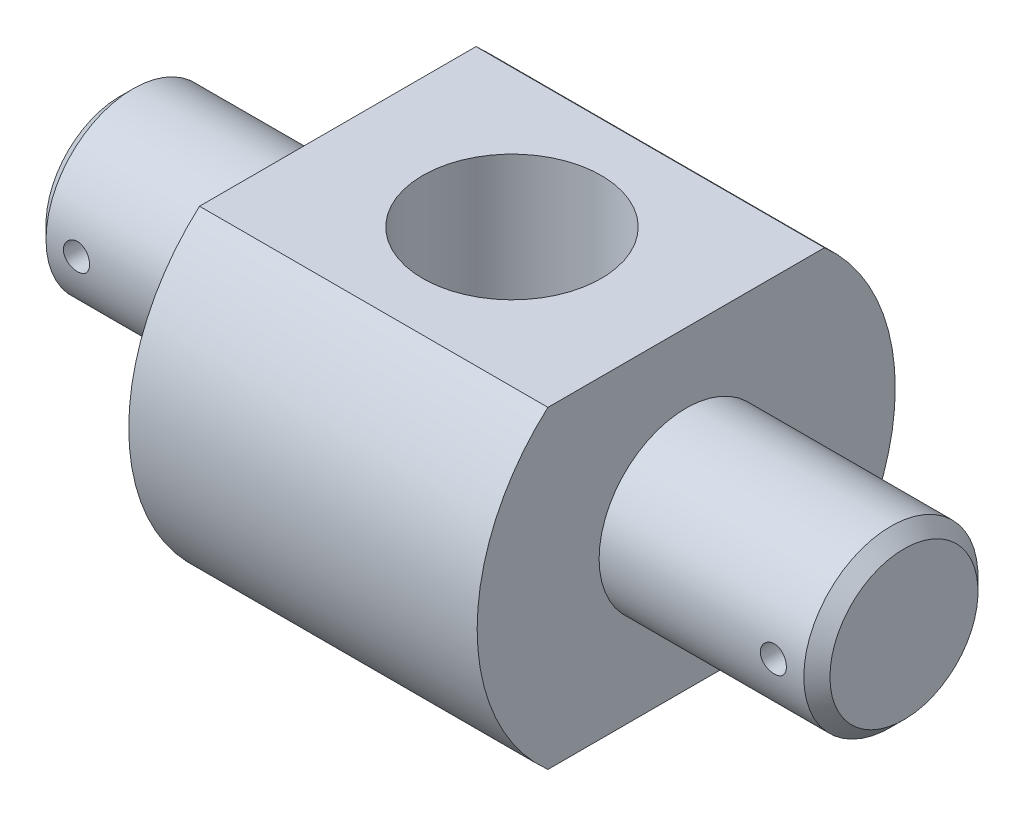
ISO-10303-21;
HEADER;
FILE_DESCRIPTION(('STEP AP214'),'2;1');
FILE_NAME('part.step','',(''),(''),'','','');
FILE_SCHEMA(('AUTOMOTIVE_DESIGN { 1 0 10303 214 1 1 1 1 }'));
ENDSEC;
DATA;
#1=APPLICATION_CONTEXT('core data for automotive mechanical design processes');
#2=APPLICATION_PROTOCOL_DEFINITION('international standard','automotive_design',2000,#1);
#3=PRODUCT_CONTEXT('',#1,'mechanical');
#4=PRODUCT('Part','Part','',(#3));
#5=PRODUCT_RELATED_PRODUCT_CATEGORY('part','',(#4));
#6=PRODUCT_DEFINITION_FORMATION('','',#4);
#7=PRODUCT_DEFINITION_CONTEXT('part definition',#1,'design');
#8=PRODUCT_DEFINITION('design','',#6,#7);
#9=PRODUCT_DEFINITION_SHAPE('','',#8);
#10=(LENGTH_UNIT() NAMED_UNIT(*) SI_UNIT(.MILLI.,.METRE.));
#11=(NAMED_UNIT(*) PLANE_ANGLE_UNIT() SI_UNIT($,.RADIAN.));
#12=(NAMED_UNIT(*) SI_UNIT($,.STERADIAN.) SOLID_ANGLE_UNIT());
#13=UNCERTAINTY_MEASURE_WITH_UNIT(LENGTH_MEASURE(1.E-05),#10,'distance_accuracy_value','');
#14=(GEOMETRIC_REPRESENTATION_CONTEXT(3) GLOBAL_UNCERTAINTY_ASSIGNED_CONTEXT((#13)) GLOBAL_UNIT_ASSIGNED_CONTEXT((#10,
#11,#12)) REPRESENTATION_CONTEXT('',''));
#15=CARTESIAN_POINT('',(0.,0.,0.));
#16=DIRECTION('',(0.,0.,1.));
#17=DIRECTION('',(1.,0.,0.));
#18=AXIS2_PLACEMENT_3D('',#15,#16,#17);
#19=CARTESIAN_POINT('',(0.,0.,0.));
#20=DIRECTION('',(-1.,0.,0.));
#21=DIRECTION('',(0.,0.,1.));
#22=AXIS2_PLACEMENT_3D('',#19,#20,#21);
#23=CYLINDRICAL_SURFACE('',#22,24.);
#24=CARTESIAN_POINT('',(65.,0.,0.));
#25=DIRECTION('',(-1.,0.,0.));
#26=DIRECTION('',(0.,0.,1.));
#27=AXIS2_PLACEMENT_3D('',#24,#25,#26);
#28=CIRCLE('',#27,24.);
#29=CARTESIAN_POINT('',(65.,18.,-15.8745078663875));
#30=VERTEX_POINT('',#29);
#31=CARTESIAN_POINT('',(65.,-18.,-15.8745078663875));
#32=VERTEX_POINT('',#31);
#33=EDGE_CURVE('E92',#30,#32,#28,.T.);
#34=ORIENTED_EDGE('',*,*,#33,.T.);
#35=DIRECTION('',(-1.,0.,0.));
#36=VECTOR('',#35,1.);
#37=CARTESIAN_POINT('',(0.,-18.,-15.8745078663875));
#38=LINE('',#37,#36);
#39=CARTESIAN_POINT('',(25.,-18.,-15.8745078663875));
#40=VERTEX_POINT('',#39);
#41=EDGE_CURVE('E54',#32,#40,#38,.T.);
#42=ORIENTED_EDGE('',*,*,#41,.T.);
#43=CARTESIAN_POINT('',(25.,0.,0.));
#44=DIRECTION('',(-1.,0.,0.));
#45=DIRECTION('',(0.,0.,1.));
#46=AXIS2_PLACEMENT_3D('',#43,#44,#45);
#47=CIRCLE('',#46,24.);
#48=CARTESIAN_POINT('',(25.,18.,-15.8745078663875));
#49=VERTEX_POINT('',#48);
#50=EDGE_CURVE('E100',#49,#40,#47,.T.);
#51=ORIENTED_EDGE('',*,*,#50,.F.);
#52=DIRECTION('',(-1.,0.,0.));
#53=VECTOR('',#52,1.);
#54=CARTESIAN_POINT('',(0.,18.,-15.8745078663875));
#55=LINE('',#54,#53);
#56=EDGE_CURVE('E205',#49,#30,#55,.F.);
#57=ORIENTED_EDGE('',*,*,#56,.T.);
#58=EDGE_LOOP('',(#34,#42,#51,#57));
#59=FACE_BOUND('',#58,.T.);
#60=ADVANCED_FACE('F33',(#59),#23,.T.);
#61=CARTESIAN_POINT('',(0.,0.,0.));
#62=DIRECTION('',(1.,0.,0.));
#63=DIRECTION('',(0.,0.,-1.));
#64=AXIS2_PLACEMENT_3D('',#61,#62,#63);
#65=PLANE('',#64);
#66=CARTESIAN_POINT('',(0.,0.,0.));
#67=DIRECTION('',(1.,0.,0.));
#68=DIRECTION('',(0.,0.,-1.));
#69=AXIS2_PLACEMENT_3D('',#66,#67,#68);
#70=CIRCLE('',#69,8.49999999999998);
#71=CARTESIAN_POINT('',(0.,0.,-8.49999999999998));
#72=VERTEX_POINT('',#71);
#73=EDGE_CURVE('E112',#72,#72,#70,.F.);
#74=ORIENTED_EDGE('',*,*,#73,.T.);
#75=EDGE_LOOP('',(#74));
#76=FACE_BOUND('',#75,.T.);
#77=ADVANCED_FACE('F35',(#76),#65,.F.);
#78=CARTESIAN_POINT('',(0.,0.,0.));
#79=DIRECTION('',(-1.,0.,0.));
#80=DIRECTION('',(0.,0.,1.));
#81=AXIS2_PLACEMENT_3D('',#78,#79,#80);
#82=CYLINDRICAL_SURFACE('',#81,9.99999999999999);
#83=CARTESIAN_POINT('',(6.5,0.,9.99999999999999));
#84=CARTESIAN_POINT('',(6.49999654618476,-0.0837515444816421,9.99999865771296));
#85=CARTESIAN_POINT('',(6.49296199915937,-0.167551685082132,9.99893682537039));
#86=CARTESIAN_POINT('',(6.46501680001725,-0.332809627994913,9.99480315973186));
#87=CARTESIAN_POINT('',(6.44409263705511,-0.414265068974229,9.99172936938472));
#88=CARTESIAN_POINT('',(6.38900749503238,-0.57241808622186,9.98391721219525));
#89=CARTESIAN_POINT('',(6.35485652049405,-0.649119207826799,9.97918010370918));
#90=CARTESIAN_POINT('',(6.27431162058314,-0.795690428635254,9.96856475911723));
#91=CARTESIAN_POINT('',(6.22791939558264,-0.865561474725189,9.96268668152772));
#92=CARTESIAN_POINT('',(6.12382273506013,-0.997046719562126,9.95039170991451));
#93=CARTESIAN_POINT('',(6.0660415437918,-1.0585998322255,9.9439713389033));
#94=CARTESIAN_POINT('',(5.94097231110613,-1.17117490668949,9.93134261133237));
#95=CARTESIAN_POINT('',(5.87368372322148,-1.22219626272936,9.92513426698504));
#96=CARTESIAN_POINT('',(5.73109935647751,-1.31249729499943,9.91359877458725));
#97=CARTESIAN_POINT('',(5.65576575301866,-1.35171787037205,9.9082761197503));
#98=CARTESIAN_POINT('',(5.49948717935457,-1.41692632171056,9.89916211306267));
#99=CARTESIAN_POINT('',(5.41854251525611,-1.44291491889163,9.89537067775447));
#100=CARTESIAN_POINT('',(5.25398195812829,-1.48073198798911,9.88978256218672));
#101=CARTESIAN_POINT('',(5.17039060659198,-1.49266503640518,9.88797115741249));
#102=CARTESIAN_POINT('',(5.00237383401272,-1.50235624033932,9.88650348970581));
#103=CARTESIAN_POINT('',(4.91794846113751,-1.50011520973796,9.88684710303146));
#104=CARTESIAN_POINT('',(4.75139891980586,-1.48160733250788,9.88963718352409));
#105=CARTESIAN_POINT('',(4.6692614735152,-1.4654569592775,9.89206618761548));
#106=CARTESIAN_POINT('',(4.50887563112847,-1.41977117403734,9.89872608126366));
#107=CARTESIAN_POINT('',(4.43062734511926,-1.39023538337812,9.90295702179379));
#108=CARTESIAN_POINT('',(4.27988662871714,-1.31849603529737,9.9127633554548));
#109=CARTESIAN_POINT('',(4.20741803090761,-1.27624314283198,9.91834396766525));
#110=CARTESIAN_POINT('',(4.07055540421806,-1.18030413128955,9.93021707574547));
#111=CARTESIAN_POINT('',(4.00616190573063,-1.12661726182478,9.936509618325));
#112=CARTESIAN_POINT('',(3.88660233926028,-1.00869493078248,9.94917473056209));
#113=CARTESIAN_POINT('',(3.83153500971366,-0.944359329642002,9.95554747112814));
#114=CARTESIAN_POINT('',(3.73296406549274,-0.807307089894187,9.96759647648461));
#115=CARTESIAN_POINT('',(3.6894605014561,-0.73459041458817,9.97327273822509));
#116=CARTESIAN_POINT('',(3.61524691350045,-0.582754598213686,9.98329515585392));
#117=CARTESIAN_POINT('',(3.5845445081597,-0.50363167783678,9.98764051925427));
#118=CARTESIAN_POINT('',(3.53689061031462,-0.341273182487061,9.99450490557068));
#119=CARTESIAN_POINT('',(3.51993818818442,-0.258037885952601,9.99702405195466));
#120=CARTESIAN_POINT('',(3.5003967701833,-0.090669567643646,9.9999358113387));
#121=CARTESIAN_POINT('',(3.49767202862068,-0.00655273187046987,10.0003485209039));
#122=CARTESIAN_POINT('',(3.50630300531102,0.160936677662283,9.99905561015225));
#123=CARTESIAN_POINT('',(3.5176582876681,0.244309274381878,9.99735005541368));
#124=CARTESIAN_POINT('',(3.55401410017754,0.407532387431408,9.99202468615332));
#125=CARTESIAN_POINT('',(3.57894849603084,0.487397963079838,9.98841415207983));
#126=CARTESIAN_POINT('',(3.64168499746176,0.641814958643,9.97968235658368));
#127=CARTESIAN_POINT('',(3.67948770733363,0.7163661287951,9.97456102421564));
#128=CARTESIAN_POINT('',(3.76720622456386,0.858634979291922,9.96332682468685));
#129=CARTESIAN_POINT('',(3.81720814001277,0.926299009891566,9.95720701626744));
#130=CARTESIAN_POINT('',(3.92778581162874,1.05232367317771,9.94467863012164));
#131=CARTESIAN_POINT('',(3.98836218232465,1.1106837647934,9.93827003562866));
#132=CARTESIAN_POINT('',(4.11897353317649,1.21693784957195,9.92582264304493));
#133=CARTESIAN_POINT('',(4.18908292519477,1.26474084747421,9.91978736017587));
#134=CARTESIAN_POINT('',(4.33641604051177,1.34789129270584,9.90883219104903));
#135=CARTESIAN_POINT('',(4.41363957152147,1.38323907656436,9.90391227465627));
#136=CARTESIAN_POINT('',(4.57273753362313,1.44033467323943,9.89577033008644));
#137=CARTESIAN_POINT('',(4.65459446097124,1.46213037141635,9.89254233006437));
#138=CARTESIAN_POINT('',(4.82085901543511,1.49165549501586,9.88813382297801));
#139=CARTESIAN_POINT('',(4.90526646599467,1.49938589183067,9.8869531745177));
#140=CARTESIAN_POINT('',(5.07332906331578,1.5005378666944,9.8867783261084));
#141=CARTESIAN_POINT('',(5.15698324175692,1.49410252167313,9.88776226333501));
#142=CARTESIAN_POINT('',(5.32200526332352,1.46741229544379,9.89175820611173));
#143=CARTESIAN_POINT('',(5.40337311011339,1.44715743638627,9.89477020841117));
#144=CARTESIAN_POINT('',(5.56147308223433,1.39345373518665,9.90247526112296));
#145=CARTESIAN_POINT('',(5.63820867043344,1.36001489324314,9.90716703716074));
#146=CARTESIAN_POINT('',(5.7850036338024,1.28090667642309,9.91770454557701));
#147=CARTESIAN_POINT('',(5.85506278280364,1.23523688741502,9.92355031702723));
#148=CARTESIAN_POINT('',(5.98724305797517,1.13244337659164,9.93580743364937));
#149=CARTESIAN_POINT('',(6.04928133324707,1.07521369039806,9.94222367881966));
#150=CARTESIAN_POINT('',(6.16292455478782,0.951148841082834,9.95485788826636));
#151=CARTESIAN_POINT('',(6.21452707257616,0.884311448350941,9.96107580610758));
#152=CARTESIAN_POINT('',(6.30608767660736,0.742495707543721,9.97265185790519));
#153=CARTESIAN_POINT('',(6.34598010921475,0.66747457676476,9.97800507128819));
#154=CARTESIAN_POINT('',(6.41253851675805,0.511751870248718,9.98720028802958));
#155=CARTESIAN_POINT('',(6.43921819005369,0.431056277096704,9.99104385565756));
#156=CARTESIAN_POINT('',(6.47254134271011,0.291665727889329,9.99590939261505));
#157=CARTESIAN_POINT('',(6.48282260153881,0.233831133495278,9.99743549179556));
#158=CARTESIAN_POINT('',(6.49655309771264,0.117338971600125,9.99948125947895));
#159=CARTESIAN_POINT('',(6.50000241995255,0.0586814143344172,10.0000009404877));
#160=CARTESIAN_POINT('',(6.5,0.,9.99999999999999));
#161=B_SPLINE_CURVE_WITH_KNOTS('',3,(#83,#84,#85,#86,#87,#88,#89,#90,#91,#92,#93,#94,#95,#96,
#97,#98,#99,#100,#101,#102,#103,#104,#105,#106,#107,#108,#109,#110,#111,#112,#113,#114,#115,
#116,#117,#118,#119,#120,#121,#122,#123,#124,#125,#126,#127,#128,#129,#130,#131,#132,#133,#134,
#135,#136,#137,#138,#139,#140,#141,#142,#143,#144,#145,#146,#147,#148,#149,#150,#151,#152,#153,
#154,#155,#156,#157,#158,#159,#160),.UNSPECIFIED.,.T.,.F.,(4,2,2,2,2,2,2,2,2,2,2,2,2,2,2,2,2,2,
2,2,2,2,2,2,2,2,2,2,2,2,2,2,2,2,2,2,2,2,4),(0.,0.251040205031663,0.502324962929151,
0.753420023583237,1.0044802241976,1.25729416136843,1.5101226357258,1.76419702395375,
2.01825756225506,2.27041564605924,2.52255925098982,2.77261177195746,3.02267136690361,
3.27371383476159,3.52477278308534,3.77834291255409,4.03191415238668,4.28563608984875,
4.53934087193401,4.79062058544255,5.04189251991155,5.29195148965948,5.54202220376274,
5.79391188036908,6.0458162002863,6.29981366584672,6.55380426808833,6.80689223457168,
7.05996272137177,7.31048888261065,7.56101464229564,7.81135073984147,8.0616953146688,
8.31444829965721,8.56726003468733,8.82146323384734,9.07540233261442,9.25129851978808,
9.42719252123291),.UNSPECIFIED.);
#162=CARTESIAN_POINT('',(6.5,0.,9.99999999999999));
#163=VERTEX_POINT('',#162);
#164=EDGE_CURVE('E125',#163,#163,#161,.T.);
#165=ORIENTED_EDGE('',*,*,#164,.T.);
#166=EDGE_LOOP('',(#165));
#167=FACE_BOUND('',#166,.T.);
#168=CARTESIAN_POINT('',(6.5,0.,-9.99999999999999));
#169=CARTESIAN_POINT('',(6.49999654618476,0.0837515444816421,-9.99999865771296));
#170=CARTESIAN_POINT('',(6.49296199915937,0.167551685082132,-9.99893682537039));
#171=CARTESIAN_POINT('',(6.46501680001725,0.332809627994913,-9.99480315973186));
#172=CARTESIAN_POINT('',(6.44409263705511,0.414265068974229,-9.99172936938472));
#173=CARTESIAN_POINT('',(6.38900749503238,0.57241808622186,-9.98391721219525));
#174=CARTESIAN_POINT('',(6.35485652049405,0.649119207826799,-9.97918010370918));
#175=CARTESIAN_POINT('',(6.27431162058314,0.795690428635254,-9.96856475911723));
#176=CARTESIAN_POINT('',(6.22791939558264,0.865561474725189,-9.96268668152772));
#177=CARTESIAN_POINT('',(6.12382273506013,0.997046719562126,-9.95039170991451));
#178=CARTESIAN_POINT('',(6.0660415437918,1.0585998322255,-9.9439713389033));
#179=CARTESIAN_POINT('',(5.94097231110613,1.17117490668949,-9.93134261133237));
#180=CARTESIAN_POINT('',(5.87368372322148,1.22219626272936,-9.92513426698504));
#181=CARTESIAN_POINT('',(5.73109935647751,1.31249729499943,-9.91359877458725));
#182=CARTESIAN_POINT('',(5.65576575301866,1.35171787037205,-9.9082761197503));
#183=CARTESIAN_POINT('',(5.49948717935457,1.41692632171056,-9.89916211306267));
#184=CARTESIAN_POINT('',(5.41854251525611,1.44291491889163,-9.89537067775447));
#185=CARTESIAN_POINT('',(5.25398195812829,1.48073198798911,-9.88978256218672));
#186=CARTESIAN_POINT('',(5.17039060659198,1.49266503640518,-9.88797115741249));
#187=CARTESIAN_POINT('',(5.00237383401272,1.50235624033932,-9.88650348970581));
#188=CARTESIAN_POINT('',(4.91794846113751,1.50011520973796,-9.88684710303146));
#189=CARTESIAN_POINT('',(4.75139891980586,1.48160733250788,-9.88963718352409));
#190=CARTESIAN_POINT('',(4.6692614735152,1.4654569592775,-9.89206618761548));
#191=CARTESIAN_POINT('',(4.50887563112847,1.41977117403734,-9.89872608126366));
#192=CARTESIAN_POINT('',(4.43062734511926,1.39023538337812,-9.90295702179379));
#193=CARTESIAN_POINT('',(4.27988662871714,1.31849603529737,-9.9127633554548));
#194=CARTESIAN_POINT('',(4.20741803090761,1.27624314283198,-9.91834396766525));
#195=CARTESIAN_POINT('',(4.07055540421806,1.18030413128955,-9.93021707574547));
#196=CARTESIAN_POINT('',(4.00616190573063,1.12661726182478,-9.936509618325));
#197=CARTESIAN_POINT('',(3.88660233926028,1.00869493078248,-9.94917473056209));
#198=CARTESIAN_POINT('',(3.83153500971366,0.944359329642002,-9.95554747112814));
#199=CARTESIAN_POINT('',(3.73296406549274,0.807307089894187,-9.96759647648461));
#200=CARTESIAN_POINT('',(3.6894605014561,0.73459041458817,-9.97327273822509));
#201=CARTESIAN_POINT('',(3.61524691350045,0.582754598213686,-9.98329515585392));
#202=CARTESIAN_POINT('',(3.5845445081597,0.50363167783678,-9.98764051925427));
#203=CARTESIAN_POINT('',(3.53689061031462,0.341273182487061,-9.99450490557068));
#204=CARTESIAN_POINT('',(3.51993818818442,0.258037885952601,-9.99702405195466));
#205=CARTESIAN_POINT('',(3.5003967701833,0.090669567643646,-9.9999358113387));
#206=CARTESIAN_POINT('',(3.49767202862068,0.00655273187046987,-10.0003485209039));
#207=CARTESIAN_POINT('',(3.50630300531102,-0.160936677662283,-9.99905561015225));
#208=CARTESIAN_POINT('',(3.5176582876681,-0.244309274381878,-9.99735005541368));
#209=CARTESIAN_POINT('',(3.55401410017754,-0.407532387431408,-9.99202468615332));
#210=CARTESIAN_POINT('',(3.57894849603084,-0.487397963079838,-9.98841415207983));
#211=CARTESIAN_POINT('',(3.64168499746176,-0.641814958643,-9.97968235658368));
#212=CARTESIAN_POINT('',(3.67948770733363,-0.7163661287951,-9.97456102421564));
#213=CARTESIAN_POINT('',(3.76720622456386,-0.858634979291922,-9.96332682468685));
#214=CARTESIAN_POINT('',(3.81720814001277,-0.926299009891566,-9.95720701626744));
#215=CARTESIAN_POINT('',(3.92778581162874,-1.05232367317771,-9.94467863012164));
#216=CARTESIAN_POINT('',(3.98836218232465,-1.1106837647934,-9.93827003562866));
#217=CARTESIAN_POINT('',(4.11897353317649,-1.21693784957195,-9.92582264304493));
#218=CARTESIAN_POINT('',(4.18908292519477,-1.26474084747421,-9.91978736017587));
#219=CARTESIAN_POINT('',(4.33641604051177,-1.34789129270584,-9.90883219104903));
#220=CARTESIAN_POINT('',(4.41363957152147,-1.38323907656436,-9.90391227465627));
#221=CARTESIAN_POINT('',(4.57273753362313,-1.44033467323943,-9.89577033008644));
#222=CARTESIAN_POINT('',(4.65459446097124,-1.46213037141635,-9.89254233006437));
#223=CARTESIAN_POINT('',(4.82085901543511,-1.49165549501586,-9.88813382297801));
#224=CARTESIAN_POINT('',(4.90526646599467,-1.49938589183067,-9.8869531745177));
#225=CARTESIAN_POINT('',(5.07332906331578,-1.5005378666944,-9.8867783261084));
#226=CARTESIAN_POINT('',(5.15698324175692,-1.49410252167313,-9.88776226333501));
#227=CARTESIAN_POINT('',(5.32200526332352,-1.46741229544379,-9.89175820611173));
#228=CARTESIAN_POINT('',(5.40337311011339,-1.44715743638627,-9.89477020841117));
#229=CARTESIAN_POINT('',(5.56147308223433,-1.39345373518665,-9.90247526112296));
#230=CARTESIAN_POINT('',(5.63820867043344,-1.36001489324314,-9.90716703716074));
#231=CARTESIAN_POINT('',(5.7850036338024,-1.28090667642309,-9.91770454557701));
#232=CARTESIAN_POINT('',(5.85506278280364,-1.23523688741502,-9.92355031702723));
#233=CARTESIAN_POINT('',(5.98724305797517,-1.13244337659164,-9.93580743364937));
#234=CARTESIAN_POINT('',(6.04928133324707,-1.07521369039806,-9.94222367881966));
#235=CARTESIAN_POINT('',(6.16292455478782,-0.951148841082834,-9.95485788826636));
#236=CARTESIAN_POINT('',(6.21452707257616,-0.884311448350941,-9.96107580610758));
#237=CARTESIAN_POINT('',(6.30608767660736,-0.742495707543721,-9.97265185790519));
#238=CARTESIAN_POINT('',(6.34598010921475,-0.66747457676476,-9.97800507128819));
#239=CARTESIAN_POINT('',(6.41253851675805,-0.511751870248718,-9.98720028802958));
#240=CARTESIAN_POINT('',(6.43921819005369,-0.431056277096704,-9.99104385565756));
#241=CARTESIAN_POINT('',(6.47254134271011,-0.291665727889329,-9.99590939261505));
#242=CARTESIAN_POINT('',(6.48282260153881,-0.233831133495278,-9.99743549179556));
#243=CARTESIAN_POINT('',(6.49655309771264,-0.117338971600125,-9.99948125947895));
#244=CARTESIAN_POINT('',(6.50000241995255,-0.0586814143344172,-10.0000009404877));
#245=CARTESIAN_POINT('',(6.5,0.,-9.99999999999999));
#246=B_SPLINE_CURVE_WITH_KNOTS('',3,(#168,#169,#170,#171,#172,#173,#174,#175,#176,#177,#178,
#179,#180,#181,#182,#183,#184,#185,#186,#187,#188,#189,#190,#191,#192,#193,#194,#195,#196,#197,
#198,#199,#200,#201,#202,#203,#204,#205,#206,#207,#208,#209,#210,#211,#212,#213,#214,#215,#216,
#217,#218,#219,#220,#221,#222,#223,#224,#225,#226,#227,#228,#229,#230,#231,#232,#233,#234,#235,
#236,#237,#238,#239,#240,#241,#242,#243,#244,#245),.UNSPECIFIED.,.T.,.F.,(4,2,2,2,2,2,2,2,2,2,2,
2,2,2,2,2,2,2,2,2,2,2,2,2,2,2,2,2,2,2,2,2,2,2,2,2,2,2,4),(0.,0.251040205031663,
0.502324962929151,0.753420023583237,1.0044802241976,1.25729416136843,1.5101226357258,
1.76419702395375,2.01825756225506,2.27041564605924,2.52255925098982,2.77261177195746,
3.02267136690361,3.27371383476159,3.52477278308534,3.77834291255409,4.03191415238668,
4.28563608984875,4.53934087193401,4.79062058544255,5.04189251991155,5.29195148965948,
5.54202220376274,5.79391188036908,6.0458162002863,6.29981366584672,6.55380426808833,
6.80689223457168,7.05996272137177,7.31048888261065,7.56101464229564,7.81135073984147,
8.0616953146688,8.31444829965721,8.56726003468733,8.82146323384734,9.07540233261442,
9.25129851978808,9.42719252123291),.UNSPECIFIED.);
#247=CARTESIAN_POINT('',(6.5,0.,-9.99999999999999));
#248=VERTEX_POINT('',#247);
#249=EDGE_CURVE('E119',#248,#248,#246,.T.);
#250=ORIENTED_EDGE('',*,*,#249,.T.);
#251=EDGE_LOOP('',(#250));
#252=FACE_BOUND('',#251,.T.);
#253=CARTESIAN_POINT('',(1.50000000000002,0.,0.));
#254=DIRECTION('',(1.,0.,0.));
#255=DIRECTION('',(0.,0.,-1.));
#256=AXIS2_PLACEMENT_3D('',#253,#254,#255);
#257=CIRCLE('',#256,9.99999999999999);
#258=CARTESIAN_POINT('',(1.50000000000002,0.,-9.99999999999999));
#259=VERTEX_POINT('',#258);
#260=EDGE_CURVE('E115',#259,#259,#257,.T.);
#261=ORIENTED_EDGE('',*,*,#260,.T.);
#262=EDGE_LOOP('',(#261));
#263=FACE_BOUND('',#262,.T.);
#264=CARTESIAN_POINT('',(25.,0.,0.));
#265=DIRECTION('',(-1.,0.,0.));
#266=DIRECTION('',(0.,0.,1.));
#267=AXIS2_PLACEMENT_3D('',#264,#265,#266);
#268=CIRCLE('',#267,9.99999999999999);
#269=CARTESIAN_POINT('',(25.,0.,9.99999999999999));
#270=VERTEX_POINT('',#269);
#271=EDGE_CURVE('E103',#270,#270,#268,.T.);
#272=ORIENTED_EDGE('',*,*,#271,.T.);
#273=EDGE_LOOP('',(#272));
#274=FACE_BOUND('',#273,.T.);
#275=ADVANCED_FACE('F128',(#167,#252,#263,#274),#82,.T.);
#276=CARTESIAN_POINT('',(25.,9.99999999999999,0.));
#277=DIRECTION('',(1.,0.,0.));
#278=DIRECTION('',(0.,0.,-1.));
#279=AXIS2_PLACEMENT_3D('',#276,#277,#278);
#280=PLANE('',#279);
#281=ORIENTED_EDGE('',*,*,#271,.F.);
#282=EDGE_LOOP('',(#281));
#283=FACE_BOUND('',#282,.T.);
#284=ORIENTED_EDGE('',*,*,#50,.T.);
#285=DIRECTION('',(0.,0.,1.));
#286=VECTOR('',#285,1.);
#287=CARTESIAN_POINT('',(25.,-18.,0.));
#288=LINE('',#287,#286);
#289=CARTESIAN_POINT('',(25.,-18.,15.8745078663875));
#290=VERTEX_POINT('',#289);
#291=EDGE_CURVE('E202',#40,#290,#288,.T.);
#292=ORIENTED_EDGE('',*,*,#291,.T.);
#293=CARTESIAN_POINT('',(25.,18.,15.8745078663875));
#294=VERTEX_POINT('',#293);
#295=EDGE_CURVE('E86',#290,#294,#47,.T.);
#296=ORIENTED_EDGE('',*,*,#295,.T.);
#297=DIRECTION('',(0.,0.,-1.));
#298=VECTOR('',#297,1.);
#299=CARTESIAN_POINT('',(25.,18.,0.));
#300=LINE('',#299,#298);
#301=EDGE_CURVE('E96',#294,#49,#300,.T.);
#302=ORIENTED_EDGE('',*,*,#301,.T.);
#303=EDGE_LOOP('',(#284,#292,#296,#302));
#304=FACE_BOUND('',#303,.T.);
#305=ADVANCED_FACE('F188',(#283,#304),#280,.F.);
#306=ORIENTED_EDGE('',*,*,#295,.F.);
#307=DIRECTION('',(-1.,0.,0.));
#308=VECTOR('',#307,1.);
#309=CARTESIAN_POINT('',(0.,-18.,15.8745078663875));
#310=LINE('',#309,#308);
#311=CARTESIAN_POINT('',(65.,-18.,15.8745078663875));
#312=VERTEX_POINT('',#311);
#313=EDGE_CURVE('E79',#290,#312,#310,.F.);
#314=ORIENTED_EDGE('',*,*,#313,.T.);
#315=CARTESIAN_POINT('',(65.,18.,15.8745078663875));
#316=VERTEX_POINT('',#315);
#317=EDGE_CURVE('E61',#312,#316,#28,.T.);
#318=ORIENTED_EDGE('',*,*,#317,.T.);
#319=DIRECTION('',(-1.,0.,0.));
#320=VECTOR('',#319,1.);
#321=CARTESIAN_POINT('',(0.,18.,15.8745078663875));
#322=LINE('',#321,#320);
#323=EDGE_CURVE('E211',#316,#294,#322,.T.);
#324=ORIENTED_EDGE('',*,*,#323,.T.);
#325=EDGE_LOOP('',(#306,#314,#318,#324));
#326=FACE_BOUND('',#325,.T.);
#327=ADVANCED_FACE('F85',(#326),#23,.T.);
#328=CARTESIAN_POINT('',(65.,24.,0.));
#329=DIRECTION('',(-1.,0.,0.));
#330=DIRECTION('',(0.,0.,1.));
#331=AXIS2_PLACEMENT_3D('',#328,#329,#330);
#332=PLANE('',#331);
#333=ORIENTED_EDGE('',*,*,#317,.F.);
#334=DIRECTION('',(0.,0.,-1.));
#335=VECTOR('',#334,1.);
#336=CARTESIAN_POINT('',(65.,-18.,0.));
#337=LINE('',#336,#335);
#338=EDGE_CURVE('E11',#312,#32,#337,.T.);
#339=ORIENTED_EDGE('',*,*,#338,.T.);
#340=ORIENTED_EDGE('',*,*,#33,.F.);
#341=DIRECTION('',(0.,0.,1.));
#342=VECTOR('',#341,1.);
#343=CARTESIAN_POINT('',(65.,18.,0.));
#344=LINE('',#343,#342);
#345=EDGE_CURVE('E46',#30,#316,#344,.T.);
#346=ORIENTED_EDGE('',*,*,#345,.T.);
#347=EDGE_LOOP('',(#333,#339,#340,#346));
#348=FACE_BOUND('',#347,.T.);
#349=CARTESIAN_POINT('',(65.,0.,0.));
#350=DIRECTION('',(-1.,0.,0.));
#351=DIRECTION('',(0.,0.,1.));
#352=AXIS2_PLACEMENT_3D('',#349,#350,#351);
#353=CIRCLE('',#352,9.99999999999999);
#354=CARTESIAN_POINT('',(65.,0.,9.99999999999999));
#355=VERTEX_POINT('',#354);
#356=EDGE_CURVE('E93',#355,#355,#353,.T.);
#357=ORIENTED_EDGE('',*,*,#356,.T.);
#358=EDGE_LOOP('',(#357));
#359=FACE_BOUND('',#358,.T.);
#360=ADVANCED_FACE('F90',(#348,#359),#332,.F.);
#361=CARTESIAN_POINT('',(0.,0.,0.));
#362=DIRECTION('',(-1.,0.,0.));
#363=DIRECTION('',(0.,0.,1.));
#364=AXIS2_PLACEMENT_3D('',#361,#362,#363);
#365=CYLINDRICAL_SURFACE('',#364,9.99999999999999);
#366=CARTESIAN_POINT('',(86.5,0.,9.99999999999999));
#367=CARTESIAN_POINT('',(86.4999965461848,-0.0837515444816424,9.99999865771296));
#368=CARTESIAN_POINT('',(86.4929619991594,-0.167551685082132,9.99893682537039));
#369=CARTESIAN_POINT('',(86.4650168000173,-0.332809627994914,9.99480315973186));
#370=CARTESIAN_POINT('',(86.4440926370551,-0.414265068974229,9.99172936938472));
#371=CARTESIAN_POINT('',(86.3890074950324,-0.572418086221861,9.98391721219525));
#372=CARTESIAN_POINT('',(86.3548565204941,-0.649119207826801,9.97918010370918));
#373=CARTESIAN_POINT('',(86.2743116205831,-0.795690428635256,9.96856475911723));
#374=CARTESIAN_POINT('',(86.2279193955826,-0.86556147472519,9.96268668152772));
#375=CARTESIAN_POINT('',(86.1238227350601,-0.997046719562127,9.95039170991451));
#376=CARTESIAN_POINT('',(86.0660415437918,-1.0585998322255,9.9439713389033));
#377=CARTESIAN_POINT('',(85.9409723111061,-1.17117490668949,9.93134261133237));
#378=CARTESIAN_POINT('',(85.8736837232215,-1.22219626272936,9.92513426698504));
#379=CARTESIAN_POINT('',(85.7310993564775,-1.31249729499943,9.91359877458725));
#380=CARTESIAN_POINT('',(85.6557657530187,-1.35171787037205,9.9082761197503));
#381=CARTESIAN_POINT('',(85.4994871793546,-1.41692632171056,9.89916211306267));
#382=CARTESIAN_POINT('',(85.4185425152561,-1.44291491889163,9.89537067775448));
#383=CARTESIAN_POINT('',(85.2539819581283,-1.48073198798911,9.88978256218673));
#384=CARTESIAN_POINT('',(85.170390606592,-1.49266503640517,9.8879711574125));
#385=CARTESIAN_POINT('',(85.0023738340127,-1.50235624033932,9.88650348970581));
#386=CARTESIAN_POINT('',(84.9179484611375,-1.50011520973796,9.88684710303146));
#387=CARTESIAN_POINT('',(84.7513989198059,-1.48160733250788,9.88963718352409));
#388=CARTESIAN_POINT('',(84.6692614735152,-1.4654569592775,9.89206618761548));
#389=CARTESIAN_POINT('',(84.5088756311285,-1.41977117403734,9.89872608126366));
#390=CARTESIAN_POINT('',(84.4306273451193,-1.39023538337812,9.90295702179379));
#391=CARTESIAN_POINT('',(84.2798866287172,-1.31849603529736,9.9127633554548));
#392=CARTESIAN_POINT('',(84.2074180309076,-1.27624314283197,9.91834396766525));
#393=CARTESIAN_POINT('',(84.0705554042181,-1.18030413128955,9.93021707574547));
#394=CARTESIAN_POINT('',(84.0061619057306,-1.12661726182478,9.936509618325));
#395=CARTESIAN_POINT('',(83.8866023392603,-1.00869493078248,9.94917473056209));
#396=CARTESIAN_POINT('',(83.8315350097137,-0.944359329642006,9.95554747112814));
#397=CARTESIAN_POINT('',(83.7329640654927,-0.807307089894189,9.96759647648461));
#398=CARTESIAN_POINT('',(83.6894605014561,-0.734590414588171,9.97327273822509));
#399=CARTESIAN_POINT('',(83.6152469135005,-0.582754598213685,9.98329515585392));
#400=CARTESIAN_POINT('',(83.5845445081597,-0.50363167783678,9.98764051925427));
#401=CARTESIAN_POINT('',(83.5368906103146,-0.341273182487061,9.99450490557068));
#402=CARTESIAN_POINT('',(83.5199381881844,-0.258037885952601,9.99702405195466));
#403=CARTESIAN_POINT('',(83.5003967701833,-0.0906695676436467,9.9999358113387));
#404=CARTESIAN_POINT('',(83.4976720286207,-0.00655273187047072,10.0003485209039));
#405=CARTESIAN_POINT('',(83.506303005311,0.160936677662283,9.99905561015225));
#406=CARTESIAN_POINT('',(83.5176582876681,0.244309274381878,9.99735005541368));
#407=CARTESIAN_POINT('',(83.5540141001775,0.40753238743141,9.99202468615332));
#408=CARTESIAN_POINT('',(83.5789484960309,0.487397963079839,9.98841415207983));
#409=CARTESIAN_POINT('',(83.6416849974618,0.641814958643,9.97968235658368));
#410=CARTESIAN_POINT('',(83.6794877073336,0.716366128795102,9.97456102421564));
#411=CARTESIAN_POINT('',(83.7672062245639,0.858634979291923,9.96332682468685));
#412=CARTESIAN_POINT('',(83.8172081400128,0.926299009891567,9.95720701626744));
#413=CARTESIAN_POINT('',(83.9277858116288,1.0523236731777,9.94467863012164));
#414=CARTESIAN_POINT('',(83.9883621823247,1.1106837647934,9.93827003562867));
#415=CARTESIAN_POINT('',(84.1189735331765,1.21693784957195,9.92582264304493));
#416=CARTESIAN_POINT('',(84.1890829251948,1.26474084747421,9.91978736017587));
#417=CARTESIAN_POINT('',(84.3364160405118,1.34789129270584,9.90883219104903));
#418=CARTESIAN_POINT('',(84.4136395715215,1.38323907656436,9.90391227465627));
#419=CARTESIAN_POINT('',(84.5727375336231,1.44033467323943,9.89577033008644));
#420=CARTESIAN_POINT('',(84.6545944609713,1.46213037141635,9.89254233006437));
#421=CARTESIAN_POINT('',(84.8208590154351,1.49165549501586,9.88813382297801));
#422=CARTESIAN_POINT('',(84.9052664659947,1.49938589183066,9.8869531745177));
#423=CARTESIAN_POINT('',(85.0733290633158,1.5005378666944,9.8867783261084));
#424=CARTESIAN_POINT('',(85.1569832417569,1.49410252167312,9.88776226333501));
#425=CARTESIAN_POINT('',(85.3220052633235,1.46741229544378,9.89175820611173));
#426=CARTESIAN_POINT('',(85.4033731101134,1.44715743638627,9.89477020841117));
#427=CARTESIAN_POINT('',(85.5614730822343,1.39345373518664,9.90247526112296));
#428=CARTESIAN_POINT('',(85.6382086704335,1.36001489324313,9.90716703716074));
#429=CARTESIAN_POINT('',(85.7850036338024,1.28090667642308,9.91770454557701));
#430=CARTESIAN_POINT('',(85.8550627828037,1.23523688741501,9.92355031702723));
#431=CARTESIAN_POINT('',(85.9872430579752,1.13244337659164,9.93580743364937));
#432=CARTESIAN_POINT('',(86.0492813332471,1.07521369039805,9.94222367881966));
#433=CARTESIAN_POINT('',(86.1629245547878,0.951148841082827,9.95485788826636));
#434=CARTESIAN_POINT('',(86.2145270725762,0.884311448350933,9.96107580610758));
#435=CARTESIAN_POINT('',(86.3060876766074,0.742495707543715,9.97265185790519));
#436=CARTESIAN_POINT('',(86.3459801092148,0.667474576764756,9.97800507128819));
#437=CARTESIAN_POINT('',(86.412538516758,0.511751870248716,9.98720028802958));
#438=CARTESIAN_POINT('',(86.4392181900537,0.431056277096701,9.99104385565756));
#439=CARTESIAN_POINT('',(86.4725413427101,0.291665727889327,9.99590939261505));
#440=CARTESIAN_POINT('',(86.4828226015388,0.233831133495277,9.99743549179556));
#441=CARTESIAN_POINT('',(86.4965530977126,0.117338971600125,9.99948125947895));
#442=CARTESIAN_POINT('',(86.5000024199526,0.058681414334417,10.0000009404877));
#443=CARTESIAN_POINT('',(86.5,0.,9.99999999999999));
#444=B_SPLINE_CURVE_WITH_KNOTS('',3,(#366,#367,#368,#369,#370,#371,#372,#373,#374,#375,#376,
#377,#378,#379,#380,#381,#382,#383,#384,#385,#386,#387,#388,#389,#390,#391,#392,#393,#394,#395,
#396,#397,#398,#399,#400,#401,#402,#403,#404,#405,#406,#407,#408,#409,#410,#411,#412,#413,#414,
#415,#416,#417,#418,#419,#420,#421,#422,#423,#424,#425,#426,#427,#428,#429,#430,#431,#432,#433,
#434,#435,#436,#437,#438,#439,#440,#441,#442,#443),.UNSPECIFIED.,.T.,.F.,(4,2,2,2,2,2,2,2,2,2,2,
2,2,2,2,2,2,2,2,2,2,2,2,2,2,2,2,2,2,2,2,2,2,2,2,2,2,2,4),(0.,0.251040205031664,
0.502324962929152,0.753420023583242,1.0044802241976,1.25729416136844,1.5101226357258,
1.76419702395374,2.01825756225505,2.27041564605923,2.52255925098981,2.77261177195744,
3.02267136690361,3.27371383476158,3.52477278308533,3.77834291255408,4.03191415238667,
4.28563608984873,4.539340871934,4.79062058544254,5.04189251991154,5.29195148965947,
5.54202220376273,5.79391188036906,6.04581620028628,6.2998136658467,6.5538042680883,
6.80689223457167,7.05996272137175,7.31048888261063,7.56101464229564,7.81135073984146,
8.06169531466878,8.31444829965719,8.56726003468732,8.82146323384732,9.0754023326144,
9.25129851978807,9.42719252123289),.UNSPECIFIED.);
#445=CARTESIAN_POINT('',(86.5,0.,9.99999999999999));
#446=VERTEX_POINT('',#445);
#447=EDGE_CURVE('E37',#446,#446,#444,.T.);
#448=ORIENTED_EDGE('',*,*,#447,.T.);
#449=EDGE_LOOP('',(#448));
#450=FACE_BOUND('',#449,.T.);
#451=CARTESIAN_POINT('',(86.5,0.,-9.99999999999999));
#452=CARTESIAN_POINT('',(86.4999965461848,0.0837515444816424,-9.99999865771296));
#453=CARTESIAN_POINT('',(86.4929619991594,0.167551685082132,-9.99893682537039));
#454=CARTESIAN_POINT('',(86.4650168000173,0.332809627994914,-9.99480315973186));
#455=CARTESIAN_POINT('',(86.4440926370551,0.414265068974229,-9.99172936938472));
#456=CARTESIAN_POINT('',(86.3890074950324,0.572418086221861,-9.98391721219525));
#457=CARTESIAN_POINT('',(86.3548565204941,0.649119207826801,-9.97918010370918));
#458=CARTESIAN_POINT('',(86.2743116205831,0.795690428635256,-9.96856475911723));
#459=CARTESIAN_POINT('',(86.2279193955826,0.86556147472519,-9.96268668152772));
#460=CARTESIAN_POINT('',(86.1238227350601,0.997046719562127,-9.95039170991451));
#461=CARTESIAN_POINT('',(86.0660415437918,1.0585998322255,-9.9439713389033));
#462=CARTESIAN_POINT('',(85.9409723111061,1.17117490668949,-9.93134261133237));
#463=CARTESIAN_POINT('',(85.8736837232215,1.22219626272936,-9.92513426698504));
#464=CARTESIAN_POINT('',(85.7310993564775,1.31249729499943,-9.91359877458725));
#465=CARTESIAN_POINT('',(85.6557657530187,1.35171787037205,-9.9082761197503));
#466=CARTESIAN_POINT('',(85.4994871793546,1.41692632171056,-9.89916211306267));
#467=CARTESIAN_POINT('',(85.4185425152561,1.44291491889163,-9.89537067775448));
#468=CARTESIAN_POINT('',(85.2539819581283,1.48073198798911,-9.88978256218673));
#469=CARTESIAN_POINT('',(85.170390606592,1.49266503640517,-9.8879711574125));
#470=CARTESIAN_POINT('',(85.0023738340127,1.50235624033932,-9.88650348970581));
#471=CARTESIAN_POINT('',(84.9179484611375,1.50011520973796,-9.88684710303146));
#472=CARTESIAN_POINT('',(84.7513989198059,1.48160733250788,-9.88963718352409));
#473=CARTESIAN_POINT('',(84.6692614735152,1.4654569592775,-9.89206618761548));
#474=CARTESIAN_POINT('',(84.5088756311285,1.41977117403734,-9.89872608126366));
#475=CARTESIAN_POINT('',(84.4306273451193,1.39023538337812,-9.90295702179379));
#476=CARTESIAN_POINT('',(84.2798866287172,1.31849603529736,-9.9127633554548));
#477=CARTESIAN_POINT('',(84.2074180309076,1.27624314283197,-9.91834396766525));
#478=CARTESIAN_POINT('',(84.0705554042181,1.18030413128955,-9.93021707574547));
#479=CARTESIAN_POINT('',(84.0061619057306,1.12661726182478,-9.936509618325));
#480=CARTESIAN_POINT('',(83.8866023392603,1.00869493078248,-9.94917473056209));
#481=CARTESIAN_POINT('',(83.8315350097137,0.944359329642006,-9.95554747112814));
#482=CARTESIAN_POINT('',(83.7329640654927,0.807307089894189,-9.96759647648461));
#483=CARTESIAN_POINT('',(83.6894605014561,0.734590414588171,-9.97327273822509));
#484=CARTESIAN_POINT('',(83.6152469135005,0.582754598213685,-9.98329515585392));
#485=CARTESIAN_POINT('',(83.5845445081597,0.50363167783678,-9.98764051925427));
#486=CARTESIAN_POINT('',(83.5368906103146,0.341273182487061,-9.99450490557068));
#487=CARTESIAN_POINT('',(83.5199381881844,0.258037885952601,-9.99702405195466));
#488=CARTESIAN_POINT('',(83.5003967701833,0.0906695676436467,-9.9999358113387));
#489=CARTESIAN_POINT('',(83.4976720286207,0.00655273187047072,-10.0003485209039));
#490=CARTESIAN_POINT('',(83.506303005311,-0.160936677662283,-9.99905561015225));
#491=CARTESIAN_POINT('',(83.5176582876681,-0.244309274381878,-9.99735005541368));
#492=CARTESIAN_POINT('',(83.5540141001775,-0.40753238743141,-9.99202468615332));
#493=CARTESIAN_POINT('',(83.5789484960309,-0.487397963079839,-9.98841415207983));
#494=CARTESIAN_POINT('',(83.6416849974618,-0.641814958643,-9.97968235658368));
#495=CARTESIAN_POINT('',(83.6794877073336,-0.716366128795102,-9.97456102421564));
#496=CARTESIAN_POINT('',(83.7672062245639,-0.858634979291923,-9.96332682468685));
#497=CARTESIAN_POINT('',(83.8172081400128,-0.926299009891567,-9.95720701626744));
#498=CARTESIAN_POINT('',(83.9277858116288,-1.0523236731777,-9.94467863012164));
#499=CARTESIAN_POINT('',(83.9883621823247,-1.1106837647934,-9.93827003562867));
#500=CARTESIAN_POINT('',(84.1189735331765,-1.21693784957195,-9.92582264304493));
#501=CARTESIAN_POINT('',(84.1890829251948,-1.26474084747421,-9.91978736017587));
#502=CARTESIAN_POINT('',(84.3364160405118,-1.34789129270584,-9.90883219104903));
#503=CARTESIAN_POINT('',(84.4136395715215,-1.38323907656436,-9.90391227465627));
#504=CARTESIAN_POINT('',(84.5727375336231,-1.44033467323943,-9.89577033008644));
#505=CARTESIAN_POINT('',(84.6545944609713,-1.46213037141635,-9.89254233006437));
#506=CARTESIAN_POINT('',(84.8208590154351,-1.49165549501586,-9.88813382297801));
#507=CARTESIAN_POINT('',(84.9052664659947,-1.49938589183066,-9.8869531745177));
#508=CARTESIAN_POINT('',(85.0733290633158,-1.5005378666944,-9.8867783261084));
#509=CARTESIAN_POINT('',(85.1569832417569,-1.49410252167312,-9.88776226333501));
#510=CARTESIAN_POINT('',(85.3220052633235,-1.46741229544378,-9.89175820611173));
#511=CARTESIAN_POINT('',(85.4033731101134,-1.44715743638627,-9.89477020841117));
#512=CARTESIAN_POINT('',(85.5614730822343,-1.39345373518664,-9.90247526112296));
#513=CARTESIAN_POINT('',(85.6382086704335,-1.36001489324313,-9.90716703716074));
#514=CARTESIAN_POINT('',(85.7850036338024,-1.28090667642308,-9.91770454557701));
#515=CARTESIAN_POINT('',(85.8550627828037,-1.23523688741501,-9.92355031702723));
#516=CARTESIAN_POINT('',(85.9872430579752,-1.13244337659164,-9.93580743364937));
#517=CARTESIAN_POINT('',(86.0492813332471,-1.07521369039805,-9.94222367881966));
#518=CARTESIAN_POINT('',(86.1629245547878,-0.951148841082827,-9.95485788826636));
#519=CARTESIAN_POINT('',(86.2145270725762,-0.884311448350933,-9.96107580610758));
#520=CARTESIAN_POINT('',(86.3060876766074,-0.742495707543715,-9.97265185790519));
#521=CARTESIAN_POINT('',(86.3459801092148,-0.667474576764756,-9.97800507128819));
#522=CARTESIAN_POINT('',(86.412538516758,-0.511751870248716,-9.98720028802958));
#523=CARTESIAN_POINT('',(86.4392181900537,-0.431056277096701,-9.99104385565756));
#524=CARTESIAN_POINT('',(86.4725413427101,-0.291665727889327,-9.99590939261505));
#525=CARTESIAN_POINT('',(86.4828226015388,-0.233831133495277,-9.99743549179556));
#526=CARTESIAN_POINT('',(86.4965530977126,-0.117338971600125,-9.99948125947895));
#527=CARTESIAN_POINT('',(86.5000024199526,-0.058681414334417,-10.0000009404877));
#528=CARTESIAN_POINT('',(86.5,0.,-9.99999999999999));
#529=B_SPLINE_CURVE_WITH_KNOTS('',3,(#451,#452,#453,#454,#455,#456,#457,#458,#459,#460,#461,
#462,#463,#464,#465,#466,#467,#468,#469,#470,#471,#472,#473,#474,#475,#476,#477,#478,#479,#480,
#481,#482,#483,#484,#485,#486,#487,#488,#489,#490,#491,#492,#493,#494,#495,#496,#497,#498,#499,
#500,#501,#502,#503,#504,#505,#506,#507,#508,#509,#510,#511,#512,#513,#514,#515,#516,#517,#518,
#519,#520,#521,#522,#523,#524,#525,#526,#527,#528),.UNSPECIFIED.,.T.,.F.,(4,2,2,2,2,2,2,2,2,2,2,
2,2,2,2,2,2,2,2,2,2,2,2,2,2,2,2,2,2,2,2,2,2,2,2,2,2,2,4),(0.,0.251040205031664,
0.502324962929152,0.753420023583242,1.0044802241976,1.25729416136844,1.5101226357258,
1.76419702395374,2.01825756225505,2.27041564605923,2.52255925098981,2.77261177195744,
3.02267136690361,3.27371383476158,3.52477278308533,3.77834291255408,4.03191415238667,
4.28563608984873,4.539340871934,4.79062058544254,5.04189251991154,5.29195148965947,
5.54202220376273,5.79391188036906,6.04581620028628,6.2998136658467,6.5538042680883,
6.80689223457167,7.05996272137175,7.31048888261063,7.56101464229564,7.81135073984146,
8.06169531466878,8.31444829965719,8.56726003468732,8.82146323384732,9.0754023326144,
9.25129851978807,9.42719252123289),.UNSPECIFIED.);
#530=CARTESIAN_POINT('',(86.5,0.,-9.99999999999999));
#531=VERTEX_POINT('',#530);
#532=EDGE_CURVE('E168',#531,#531,#529,.T.);
#533=ORIENTED_EDGE('',*,*,#532,.T.);
#534=EDGE_LOOP('',(#533));
#535=FACE_BOUND('',#534,.T.);
#536=CARTESIAN_POINT('',(88.5,0.,0.));
#537=DIRECTION('',(-1.,0.,0.));
#538=DIRECTION('',(0.,0.,1.));
#539=AXIS2_PLACEMENT_3D('',#536,#537,#538);
#540=CIRCLE('',#539,9.99999999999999);
#541=CARTESIAN_POINT('',(88.5,0.,9.99999999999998));
#542=VERTEX_POINT('',#541);
#543=EDGE_CURVE('E106',#542,#542,#540,.T.);
#544=ORIENTED_EDGE('',*,*,#543,.T.);
#545=EDGE_LOOP('',(#544));
#546=FACE_BOUND('',#545,.T.);
#547=ORIENTED_EDGE('',*,*,#356,.F.);
#548=EDGE_LOOP('',(#547));
#549=FACE_BOUND('',#548,.T.);
#550=ADVANCED_FACE('F160',(#450,#535,#546,#549),#365,.T.);
#551=CARTESIAN_POINT('',(90.,9.99999999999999,0.));
#552=DIRECTION('',(-1.,0.,0.));
#553=DIRECTION('',(0.,0.,1.));
#554=AXIS2_PLACEMENT_3D('',#551,#552,#553);
#555=PLANE('',#554);
#556=CARTESIAN_POINT('',(90.,0.,0.));
#557=DIRECTION('',(-1.,0.,0.));
#558=DIRECTION('',(0.,0.,1.));
#559=AXIS2_PLACEMENT_3D('',#556,#557,#558);
#560=CIRCLE('',#559,8.50000000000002);
#561=CARTESIAN_POINT('',(90.,0.,8.50000000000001));
#562=VERTEX_POINT('',#561);
#563=EDGE_CURVE('E109',#562,#562,#560,.F.);
#564=ORIENTED_EDGE('',*,*,#563,.T.);
#565=EDGE_LOOP('',(#564));
#566=FACE_BOUND('',#565,.T.);
#567=ADVANCED_FACE('F157',(#566),#555,.F.);
#568=CARTESIAN_POINT('',(88.5,0.,0.));
#569=DIRECTION('',(-1.,0.,0.));
#570=DIRECTION('',(0.,0.,1.));
#571=AXIS2_PLACEMENT_3D('',#568,#569,#570);
#572=CONICAL_SURFACE('',#571,9.99999999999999,0.785398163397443);
#573=CARTESIAN_POINT('',(90.,0.,8.50000000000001));
#574=CARTESIAN_POINT('',(89.984375,0.,8.51562500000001));
#575=CARTESIAN_POINT('',(89.96875,0.,8.53125000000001));
#576=CARTESIAN_POINT('',(89.9375,0.,8.56250000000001));
#577=CARTESIAN_POINT('',(89.921875,0.,8.57812500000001));
#578=CARTESIAN_POINT('',(89.890625,0.,8.60937500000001));
#579=CARTESIAN_POINT('',(89.875,0.,8.62500000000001));
#580=CARTESIAN_POINT('',(89.84375,0.,8.65625000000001));
#581=CARTESIAN_POINT('',(89.828125,0.,8.67187500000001));
#582=CARTESIAN_POINT('',(89.796875,0.,8.70312500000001));
#583=CARTESIAN_POINT('',(89.78125,0.,8.71875000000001));
#584=CARTESIAN_POINT('',(89.75,0.,8.75000000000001));
#585=CARTESIAN_POINT('',(89.734375,0.,8.76562500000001));
#586=CARTESIAN_POINT('',(89.703125,0.,8.79687500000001));
#587=CARTESIAN_POINT('',(89.6875,0.,8.81250000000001));
#588=CARTESIAN_POINT('',(89.65625,0.,8.84375000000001));
#589=CARTESIAN_POINT('',(89.640625,0.,8.85937500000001));
#590=CARTESIAN_POINT('',(89.609375,0.,8.89062500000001));
#591=CARTESIAN_POINT('',(89.59375,0.,8.90625000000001));
#592=CARTESIAN_POINT('',(89.5625,0.,8.93750000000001));
#593=CARTESIAN_POINT('',(89.546875,0.,8.95312500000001));
#594=CARTESIAN_POINT('',(89.515625,0.,8.98437500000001));
#595=CARTESIAN_POINT('',(89.5,0.,9.));
#596=CARTESIAN_POINT('',(89.46875,0.,9.03125));
#597=CARTESIAN_POINT('',(89.453125,0.,9.046875));
#598=CARTESIAN_POINT('',(89.421875,0.,9.078125));
#599=CARTESIAN_POINT('',(89.40625,0.,9.09375000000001));
#600=CARTESIAN_POINT('',(89.375,0.,9.12500000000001));
#601=CARTESIAN_POINT('',(89.359375,0.,9.140625));
#602=CARTESIAN_POINT('',(89.328125,0.,9.171875));
#603=CARTESIAN_POINT('',(89.3125,0.,9.1875));
#604=CARTESIAN_POINT('',(89.28125,0.,9.21875));
#605=CARTESIAN_POINT('',(89.265625,0.,9.234375));
#606=CARTESIAN_POINT('',(89.234375,0.,9.265625));
#607=CARTESIAN_POINT('',(89.21875,0.,9.28125));
#608=CARTESIAN_POINT('',(89.1875,0.,9.3125));
#609=CARTESIAN_POINT('',(89.171875,0.,9.328125));
#610=CARTESIAN_POINT('',(89.140625,0.,9.359375));
#611=CARTESIAN_POINT('',(89.125,0.,9.37499999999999));
#612=CARTESIAN_POINT('',(89.09375,0.,9.40624999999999));
#613=CARTESIAN_POINT('',(89.078125,0.,9.421875));
#614=CARTESIAN_POINT('',(89.046875,0.,9.453125));
#615=CARTESIAN_POINT('',(89.03125,0.,9.46875));
#616=CARTESIAN_POINT('',(89.,0.,9.49999999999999));
#617=CARTESIAN_POINT('',(88.984375,0.,9.51562499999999));
#618=CARTESIAN_POINT('',(88.953125,0.,9.54687499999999));
#619=CARTESIAN_POINT('',(88.9375,0.,9.56249999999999));
#620=CARTESIAN_POINT('',(88.90625,0.,9.59374999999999));
#621=CARTESIAN_POINT('',(88.890625,0.,9.60937499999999));
#622=CARTESIAN_POINT('',(88.859375,0.,9.64062499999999));
#623=CARTESIAN_POINT('',(88.84375,0.,9.65624999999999));
#624=CARTESIAN_POINT('',(88.8125,0.,9.68749999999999));
#625=CARTESIAN_POINT('',(88.796875,0.,9.70312499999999));
#626=CARTESIAN_POINT('',(88.765625,0.,9.73437499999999));
#627=CARTESIAN_POINT('',(88.75,0.,9.74999999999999));
#628=CARTESIAN_POINT('',(88.71875,0.,9.78124999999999));
#629=CARTESIAN_POINT('',(88.703125,0.,9.79687499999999));
#630=CARTESIAN_POINT('',(88.671875,0.,9.82812499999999));
#631=CARTESIAN_POINT('',(88.65625,0.,9.84374999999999));
#632=CARTESIAN_POINT('',(88.625,0.,9.87499999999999));
#633=CARTESIAN_POINT('',(88.609375,0.,9.89062499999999));
#634=CARTESIAN_POINT('',(88.578125,0.,9.92187499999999));
#635=CARTESIAN_POINT('',(88.5625,0.,9.93749999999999));
#636=CARTESIAN_POINT('',(88.53125,0.,9.96874999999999));
#637=CARTESIAN_POINT('',(88.515625,0.,9.98437499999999));
#638=CARTESIAN_POINT('',(88.5,0.,9.99999999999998));
#639=B_SPLINE_CURVE_WITH_KNOTS('',3,(#573,#574,#575,#576,#577,#578,#579,#580,#581,#582,#583,
#584,#585,#586,#587,#588,#589,#590,#591,#592,#593,#594,#595,#596,#597,#598,#599,#600,#601,#602,
#603,#604,#605,#606,#607,#608,#609,#610,#611,#612,#613,#614,#615,#616,#617,#618,#619,#620,#621,
#622,#623,#624,#625,#626,#627,#628,#629,#630,#631,#632,#633,#634,#635,#636,#637,#638),
.UNSPECIFIED.,.F.,.F.,(4,2,2,2,2,2,2,2,2,2,2,2,2,2,2,2,2,2,2,2,2,2,2,2,2,2,2,2,2,2,2,2,4),(0.,
0.0662912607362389,0.132582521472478,0.198873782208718,0.265165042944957,0.331456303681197,
0.397747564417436,0.464038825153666,0.530330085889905,0.596621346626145,0.662912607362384,
0.729203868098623,0.795495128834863,0.861786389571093,0.928077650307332,0.994368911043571,
1.06066017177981,1.12695143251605,1.19324269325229,1.25953395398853,1.32582521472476,
1.392116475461,1.45840773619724,1.52469899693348,1.59099025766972,1.65728151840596,
1.72357277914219,1.78986403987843,1.85615530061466,1.9224465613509,1.98873782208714,
2.05502908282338,2.12132034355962),.UNSPECIFIED.);
#640=EDGE_CURVE('BSEAM153',#562,#542,#639,.T.);
#641=ORIENTED_EDGE('',*,*,#563,.F.);
#642=ORIENTED_EDGE('',*,*,#543,.F.);
#643=ORIENTED_EDGE('',*,*,#640,.T.);
#644=ORIENTED_EDGE('',*,*,#640,.F.);
#645=EDGE_LOOP('',(#641,#643,#642,#644));
#646=FACE_BOUND('',#645,.T.);
#647=ADVANCED_FACE('F153',(#646),#572,.T.);
#648=CARTESIAN_POINT('',(0.,0.,0.));
#649=DIRECTION('',(1.,0.,0.));
#650=DIRECTION('',(0.,0.,-1.));
#651=AXIS2_PLACEMENT_3D('',#648,#649,#650);
#652=CONICAL_SURFACE('',#651,8.49999999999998,0.785398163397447);
#653=ORIENTED_EDGE('',*,*,#260,.F.);
#654=EDGE_LOOP('',(#653));
#655=FACE_BOUND('',#654,.T.);
#656=ORIENTED_EDGE('',*,*,#73,.F.);
#657=EDGE_LOOP('',(#656));
#658=FACE_BOUND('',#657,.T.);
#659=ADVANCED_FACE('F149',(#655,#658),#652,.T.);
#660=CARTESIAN_POINT('',(74.4383149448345,18.,-24.));
#661=DIRECTION('',(0.,-1.,0.));
#662=DIRECTION('',(1.,0.,0.));
#663=AXIS2_PLACEMENT_3D('',#660,#661,#662);
#664=PLANE('',#663);
#665=CARTESIAN_POINT('',(45.,18.,0.));
#666=DIRECTION('',(0.,1.,0.));
#667=DIRECTION('',(-1.,0.,0.));
#668=AXIS2_PLACEMENT_3D('',#665,#666,#667);
#669=CIRCLE('',#668,10.25);
#670=CARTESIAN_POINT('',(34.75,18.,0.));
#671=VERTEX_POINT('',#670);
#672=EDGE_CURVE('E215',#671,#671,#669,.T.);
#673=ORIENTED_EDGE('',*,*,#672,.F.);
#674=EDGE_LOOP('',(#673));
#675=FACE_BOUND('',#674,.T.);
#676=ORIENTED_EDGE('',*,*,#323,.F.);
#677=ORIENTED_EDGE('',*,*,#345,.F.);
#678=ORIENTED_EDGE('',*,*,#56,.F.);
#679=ORIENTED_EDGE('',*,*,#301,.F.);
#680=EDGE_LOOP('',(#676,#677,#678,#679));
#681=FACE_BOUND('',#680,.T.);
#682=ADVANCED_FACE('F145',(#675,#681),#664,.F.);
#683=CARTESIAN_POINT('',(14.6589769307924,-18.,-24.));
#684=DIRECTION('',(0.,1.,0.));
#685=DIRECTION('',(0.,0.,1.));
#686=AXIS2_PLACEMENT_3D('',#683,#684,#685);
#687=PLANE('',#686);
#688=CARTESIAN_POINT('',(45.,-18.,0.));
#689=DIRECTION('',(0.,1.,0.));
#690=DIRECTION('',(-1.,0.,0.));
#691=AXIS2_PLACEMENT_3D('',#688,#689,#690);
#692=CIRCLE('',#691,10.25);
#693=CARTESIAN_POINT('',(34.75,-18.,0.));
#694=VERTEX_POINT('',#693);
#695=EDGE_CURVE('E87',#694,#694,#692,.T.);
#696=ORIENTED_EDGE('',*,*,#695,.T.);
#697=EDGE_LOOP('',(#696));
#698=FACE_BOUND('',#697,.T.);
#699=ORIENTED_EDGE('',*,*,#41,.F.);
#700=ORIENTED_EDGE('',*,*,#338,.F.);
#701=ORIENTED_EDGE('',*,*,#313,.F.);
#702=ORIENTED_EDGE('',*,*,#291,.F.);
#703=EDGE_LOOP('',(#699,#700,#701,#702));
#704=FACE_BOUND('',#703,.T.);
#705=ADVANCED_FACE('F78',(#698,#704),#687,.F.);
#706=CARTESIAN_POINT('',(45.,-18.,0.));
#707=DIRECTION('',(0.,1.,0.));
#708=DIRECTION('',(-1.,0.,0.));
#709=AXIS2_PLACEMENT_3D('',#706,#707,#708);
#710=CYLINDRICAL_SURFACE('',#709,10.25);
#711=ORIENTED_EDGE('',*,*,#695,.F.);
#712=EDGE_LOOP('',(#711));
#713=FACE_BOUND('',#712,.T.);
#714=ORIENTED_EDGE('',*,*,#672,.T.);
#715=EDGE_LOOP('',(#714));
#716=FACE_BOUND('',#715,.T.);
#717=ADVANCED_FACE('F136',(#713,#716),#710,.F.);
#718=CARTESIAN_POINT('',(5.,0.,-24.));
#719=DIRECTION('',(0.,0.,1.));
#720=DIRECTION('',(1.,0.,0.));
#721=AXIS2_PLACEMENT_3D('',#718,#719,#720);
#722=CYLINDRICAL_SURFACE('',#721,1.5);
#723=ORIENTED_EDGE('',*,*,#249,.F.);
#724=EDGE_LOOP('',(#723));
#725=FACE_BOUND('',#724,.T.);
#726=ORIENTED_EDGE('',*,*,#164,.F.);
#727=EDGE_LOOP('',(#726));
#728=FACE_BOUND('',#727,.T.);
#729=ADVANCED_FACE('F131',(#725,#728),#722,.F.);
#730=CARTESIAN_POINT('',(85.,0.,-24.));
#731=DIRECTION('',(0.,0.,1.));
#732=DIRECTION('',(1.,0.,0.));
#733=AXIS2_PLACEMENT_3D('',#730,#731,#732);
#734=CYLINDRICAL_SURFACE('',#733,1.5);
#735=ORIENTED_EDGE('',*,*,#532,.F.);
#736=EDGE_LOOP('',(#735));
#737=FACE_BOUND('',#736,.T.);
#738=ORIENTED_EDGE('',*,*,#447,.F.);
#739=EDGE_LOOP('',(#738));
#740=FACE_BOUND('',#739,.T.);
#741=ADVANCED_FACE('F135',(#737,#740),#734,.F.);
#742=CLOSED_SHELL('',(#60,#77,#275,#305,#327,#360,#550,#567,#647,#659,#682,#705,#717,#729,#741));
#743=MANIFOLD_SOLID_BREP('B2',#742);
#744=ADVANCED_BREP_SHAPE_REPRESENTATION('',(#18,#743),#14);
#745=SHAPE_DEFINITION_REPRESENTATION(#9,#744);
ENDSEC;
END-ISO-10303-21;
